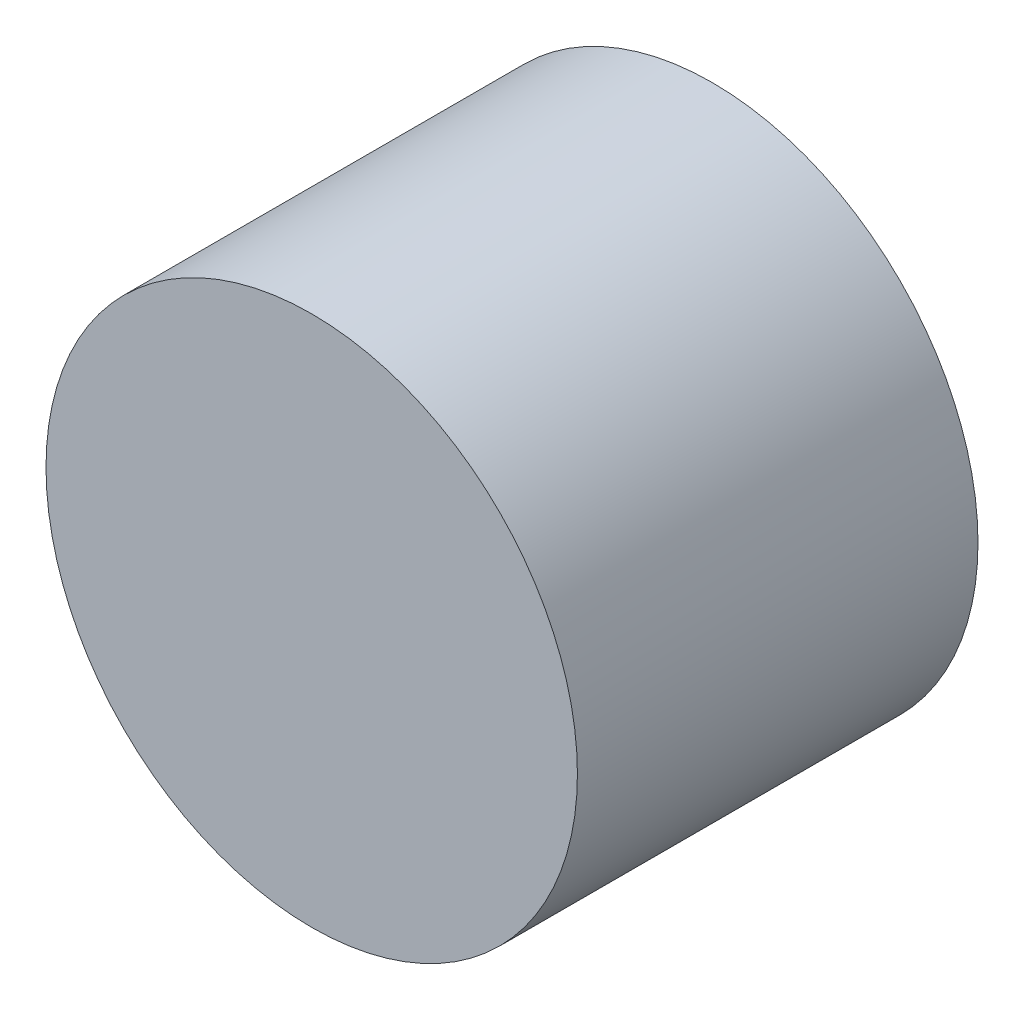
from build123d import *

# Parameters (mm, degrees)
ESQUISSE1_R      = 1.99
EXTRUSION1_DEPTH = 3


with BuildPart() as part:
    # Esquisse1 → Extrusion1 (new body)
    with BuildSketch(Plane.XY):
        Circle(ESQUISSE1_R)
    extrude(amount=EXTRUSION1_DEPTH)


solid = part.part
